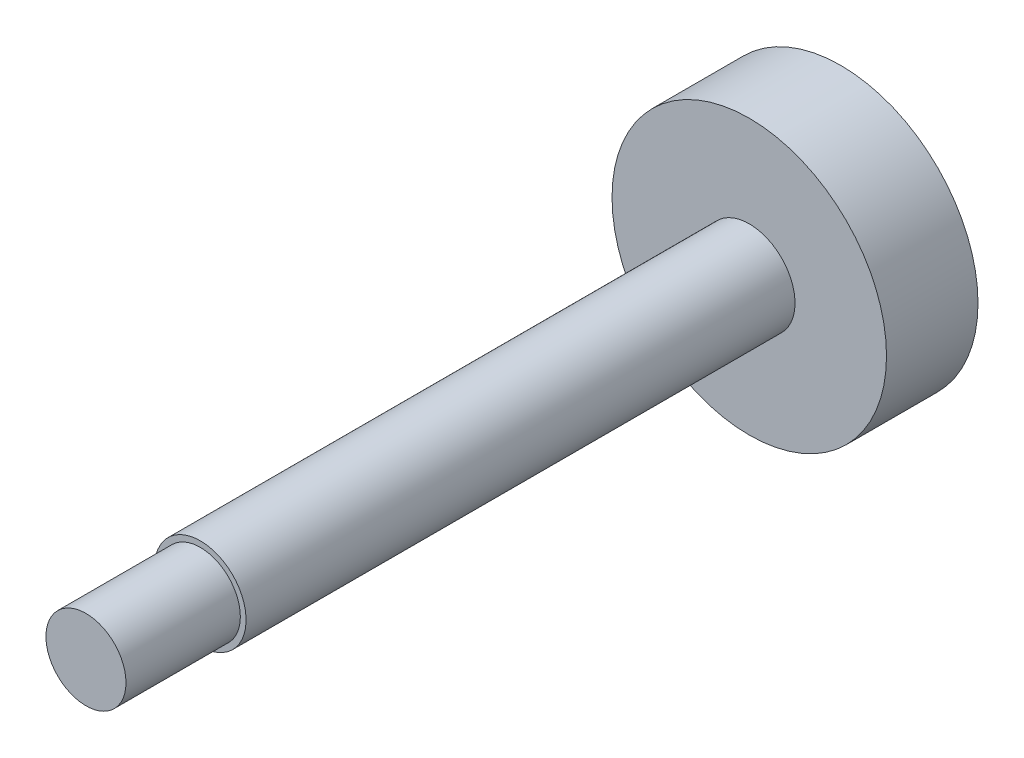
from build123d import *

# Parameters (mm, degrees)
SKETCH1_R      = 38.1
EXTRUDE1_DEPTH = 25.4
SKETCH2_R      = 12.7
EXTRUDE2_DEPTH = 152.4
SKETCH3_R      = 11.1125
EXTRUDE3_DEPTH = 31.75


with BuildPart() as part:
    # Sketch1 → Extrude1 (new body)
    with BuildSketch(Plane.XY):
        Circle(SKETCH1_R)
    extrude(amount=EXTRUDE1_DEPTH)

    # Sketch2 → Extrude2 (add)
    with BuildSketch(Plane.XY.offset(25.4)):
        with Locations(Location((0, 0, 0), (0, 0, 180))):
            Circle(SKETCH2_R)
    extrude(amount=EXTRUDE2_DEPTH)

    # Sketch3 → Extrude3 (add)
    with BuildSketch(Plane.XY.offset(177.8)):
        Circle(SKETCH3_R)
    extrude(amount=EXTRUDE3_DEPTH)


solid = part.part
